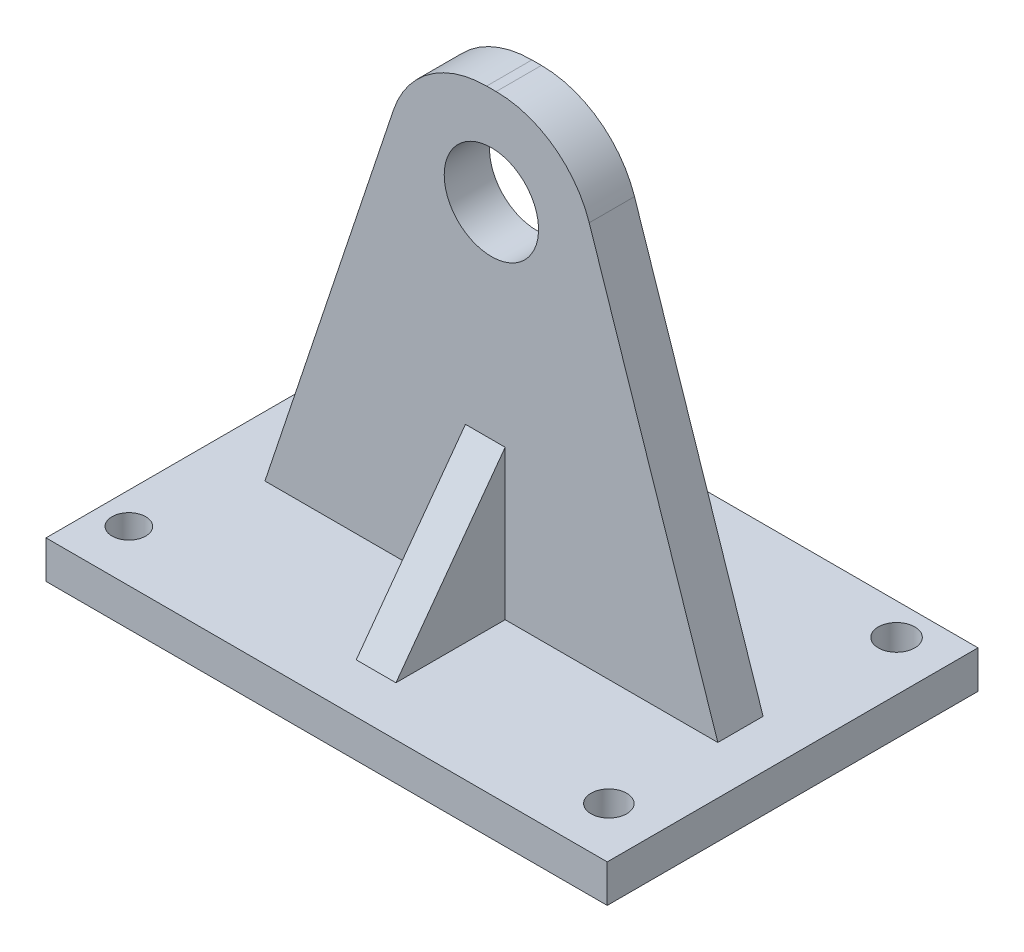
ISO-10303-21;
HEADER;
FILE_DESCRIPTION(('STEP AP214'),'2;1');
FILE_NAME('part.step','',(''),(''),'','','');
FILE_SCHEMA(('AUTOMOTIVE_DESIGN { 1 0 10303 214 1 1 1 1 }'));
ENDSEC;
DATA;
#1=APPLICATION_CONTEXT('core data for automotive mechanical design processes');
#2=APPLICATION_PROTOCOL_DEFINITION('international standard','automotive_design',2000,#1);
#3=PRODUCT_CONTEXT('',#1,'mechanical');
#4=PRODUCT('Part','Part','',(#3));
#5=PRODUCT_RELATED_PRODUCT_CATEGORY('part','',(#4));
#6=PRODUCT_DEFINITION_FORMATION('','',#4);
#7=PRODUCT_DEFINITION_CONTEXT('part definition',#1,'design');
#8=PRODUCT_DEFINITION('design','',#6,#7);
#9=PRODUCT_DEFINITION_SHAPE('','',#8);
#10=(LENGTH_UNIT() NAMED_UNIT(*) SI_UNIT(.MILLI.,.METRE.));
#11=(NAMED_UNIT(*) PLANE_ANGLE_UNIT() SI_UNIT($,.RADIAN.));
#12=(NAMED_UNIT(*) SI_UNIT($,.STERADIAN.) SOLID_ANGLE_UNIT());
#13=UNCERTAINTY_MEASURE_WITH_UNIT(LENGTH_MEASURE(1.E-05),#10,'distance_accuracy_value','');
#14=(GEOMETRIC_REPRESENTATION_CONTEXT(3) GLOBAL_UNCERTAINTY_ASSIGNED_CONTEXT((#13)) GLOBAL_UNIT_ASSIGNED_CONTEXT((#10,
#11,#12)) REPRESENTATION_CONTEXT('',''));
#15=CARTESIAN_POINT('',(0.,0.,0.));
#16=DIRECTION('',(0.,0.,1.));
#17=DIRECTION('',(1.,0.,0.));
#18=AXIS2_PLACEMENT_3D('',#15,#16,#17);
#19=CARTESIAN_POINT('',(38.9002652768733,59.69,7.62));
#20=DIRECTION('',(0.,0.,1.));
#21=DIRECTION('',(1.,0.,0.));
#22=AXIS2_PLACEMENT_3D('',#19,#20,#21);
#23=PLANE('',#22);
#24=DIRECTION('',(-0.316227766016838,0.948683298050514,0.));
#25=VECTOR('',#24,1.);
#26=CARTESIAN_POINT('',(76.2,0.,7.62));
#27=LINE('',#26,#25);
#28=CARTESIAN_POINT('',(76.2,0.,7.62));
#29=VERTEX_POINT('',#28);
#30=CARTESIAN_POINT('',(54.5630265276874,64.9109204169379,7.62));
#31=VERTEX_POINT('',#30);
#32=EDGE_CURVE('E257',#29,#31,#27,.T.);
#33=ORIENTED_EDGE('',*,*,#32,.T.);
#34=CARTESIAN_POINT('',(38.9002652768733,59.69,7.62));
#35=DIRECTION('',(0.,0.,1.));
#36=DIRECTION('',(1.,0.,0.));
#37=AXIS2_PLACEMENT_3D('',#34,#35,#36);
#38=CIRCLE('',#37,16.51);
#39=CARTESIAN_POINT('',(38.9002652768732,76.2,7.62));
#40=VERTEX_POINT('',#39);
#41=EDGE_CURVE('E259',#31,#40,#38,.T.);
#42=ORIENTED_EDGE('',*,*,#41,.T.);
#43=DIRECTION('',(-1.,0.,0.));
#44=VECTOR('',#43,1.);
#45=CARTESIAN_POINT('',(38.9002652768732,76.2,7.62));
#46=LINE('',#45,#44);
#47=CARTESIAN_POINT('',(37.2997347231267,76.2,7.62));
#48=VERTEX_POINT('',#47);
#49=EDGE_CURVE('E261',#40,#48,#46,.T.);
#50=ORIENTED_EDGE('',*,*,#49,.T.);
#51=CARTESIAN_POINT('',(37.2997347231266,59.69,7.62));
#52=DIRECTION('',(0.,0.,1.));
#53=DIRECTION('',(-1.,0.,0.));
#54=AXIS2_PLACEMENT_3D('',#51,#52,#53);
#55=CIRCLE('',#54,16.51);
#56=CARTESIAN_POINT('',(21.6369734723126,64.9109204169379,7.62));
#57=VERTEX_POINT('',#56);
#58=EDGE_CURVE('E263',#48,#57,#55,.T.);
#59=ORIENTED_EDGE('',*,*,#58,.T.);
#60=DIRECTION('',(-0.316227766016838,-0.948683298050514,0.));
#61=VECTOR('',#60,1.);
#62=CARTESIAN_POINT('',(21.6369734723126,64.9109204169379,7.62));
#63=LINE('',#62,#61);
#64=CARTESIAN_POINT('',(0.,0.,7.62));
#65=VERTEX_POINT('',#64);
#66=EDGE_CURVE('E251',#57,#65,#63,.T.);
#67=ORIENTED_EDGE('',*,*,#66,.T.);
#68=DIRECTION('',(1.,0.,0.));
#69=VECTOR('',#68,1.);
#70=CARTESIAN_POINT('',(0.,0.,7.62));
#71=LINE('',#70,#69);
#72=CARTESIAN_POINT('',(33.7352719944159,0.,7.62));
#73=VERTEX_POINT('',#72);
#74=EDGE_CURVE('E254',#65,#73,#71,.T.);
#75=ORIENTED_EDGE('',*,*,#74,.T.);
#76=DIRECTION('',(0.,-1.,0.));
#77=VECTOR('',#76,1.);
#78=CARTESIAN_POINT('',(33.7352719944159,0.,7.62));
#79=LINE('',#78,#77);
#80=CARTESIAN_POINT('',(33.7352719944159,25.1294228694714,7.62));
#81=VERTEX_POINT('',#80);
#82=EDGE_CURVE('E197',#81,#73,#79,.T.);
#83=ORIENTED_EDGE('',*,*,#82,.F.);
#84=DIRECTION('',(-1.,0.,0.));
#85=VECTOR('',#84,1.);
#86=CARTESIAN_POINT('',(40.4193128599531,25.1294228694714,7.62));
#87=LINE('',#86,#85);
#88=CARTESIAN_POINT('',(40.4193128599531,25.1294228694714,7.62));
#89=VERTEX_POINT('',#88);
#90=EDGE_CURVE('E194',#89,#81,#87,.T.);
#91=ORIENTED_EDGE('',*,*,#90,.F.);
#92=DIRECTION('',(0.,1.,0.));
#93=VECTOR('',#92,1.);
#94=CARTESIAN_POINT('',(40.4193128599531,0.,7.62));
#95=LINE('',#94,#93);
#96=CARTESIAN_POINT('',(40.4193128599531,0.,7.62));
#97=VERTEX_POINT('',#96);
#98=EDGE_CURVE('E192',#97,#89,#95,.T.);
#99=ORIENTED_EDGE('',*,*,#98,.F.);
#100=EDGE_CURVE('E253',#97,#29,#71,.T.);
#101=ORIENTED_EDGE('',*,*,#100,.T.);
#102=EDGE_LOOP('',(#33,#42,#50,#59,#67,#75,#83,#91,#99,#101));
#103=FACE_BOUND('',#102,.T.);
#104=CARTESIAN_POINT('',(38.1,59.69,7.62));
#105=DIRECTION('',(0.,0.,1.));
#106=DIRECTION('',(1.,0.,0.));
#107=AXIS2_PLACEMENT_3D('',#104,#105,#106);
#108=CIRCLE('',#107,7.93673466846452);
#109=CARTESIAN_POINT('',(30.1632653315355,59.69,7.62));
#110=VERTEX_POINT('',#109);
#111=EDGE_CURVE('E239',#110,#110,#108,.T.);
#112=ORIENTED_EDGE('',*,*,#111,.F.);
#113=EDGE_LOOP('',(#112));
#114=FACE_BOUND('',#113,.T.);
#115=ADVANCED_FACE('F34',(#103,#114),#23,.T.);
#116=CARTESIAN_POINT('',(-10.137707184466,0.,-28.0643860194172));
#117=DIRECTION('',(0.,-1.,0.));
#118=DIRECTION('',(0.,0.,-1.));
#119=AXIS2_PLACEMENT_3D('',#116,#117,#118);
#120=PLANE('',#119);
#121=CARTESIAN_POINT('',(-4.8379274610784,0.,25.6797639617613));
#122=DIRECTION('',(0.,1.,0.));
#123=DIRECTION('',(0.,0.,1.));
#124=AXIS2_PLACEMENT_3D('',#121,#122,#123);
#125=CIRCLE('',#124,2.83370500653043);
#126=CARTESIAN_POINT('',(-4.8379274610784,0.,28.5134689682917));
#127=VERTEX_POINT('',#126);
#128=EDGE_CURVE('E292',#127,#127,#125,.T.);
#129=ORIENTED_EDGE('',*,*,#128,.F.);
#130=EDGE_LOOP('',(#129));
#131=FACE_BOUND('',#130,.T.);
#132=CARTESIAN_POINT('',(-4.8379274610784,0.,-22.7293632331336));
#133=DIRECTION('',(0.,1.,0.));
#134=DIRECTION('',(0.,0.,1.));
#135=AXIS2_PLACEMENT_3D('',#132,#133,#134);
#136=CIRCLE('',#135,2.83370500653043);
#137=CARTESIAN_POINT('',(-4.8379274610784,0.,-19.8956582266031));
#138=VERTEX_POINT('',#137);
#139=EDGE_CURVE('E283',#138,#138,#136,.T.);
#140=ORIENTED_EDGE('',*,*,#139,.F.);
#141=EDGE_LOOP('',(#140));
#142=FACE_BOUND('',#141,.T.);
#143=CARTESIAN_POINT('',(75.9226652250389,0.,-22.7293632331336));
#144=DIRECTION('',(0.,1.,0.));
#145=DIRECTION('',(0.,0.,1.));
#146=AXIS2_PLACEMENT_3D('',#143,#144,#145);
#147=CIRCLE('',#146,3.06984709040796);
#148=CARTESIAN_POINT('',(75.9226652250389,0.,-19.6595161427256));
#149=VERTEX_POINT('',#148);
#150=EDGE_CURVE('E280',#149,#149,#147,.T.);
#151=ORIENTED_EDGE('',*,*,#150,.F.);
#152=EDGE_LOOP('',(#151));
#153=FACE_BOUND('',#152,.T.);
#154=CARTESIAN_POINT('',(75.9226652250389,0.,25.6797639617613));
#155=DIRECTION('',(0.,1.,0.));
#156=DIRECTION('',(0.,0.,1.));
#157=AXIS2_PLACEMENT_3D('',#154,#155,#156);
#158=CIRCLE('',#157,3.00559803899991);
#159=CARTESIAN_POINT('',(75.9226652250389,0.,28.6853620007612));
#160=VERTEX_POINT('',#159);
#161=EDGE_CURVE('E172',#160,#160,#158,.T.);
#162=ORIENTED_EDGE('',*,*,#161,.F.);
#163=EDGE_LOOP('',(#162));
#164=FACE_BOUND('',#163,.T.);
#165=DIRECTION('',(1.,0.,0.));
#166=VECTOR('',#165,1.);
#167=CARTESIAN_POINT('',(0.,0.,0.));
#168=LINE('',#167,#166);
#169=CARTESIAN_POINT('',(0.,0.,0.));
#170=VERTEX_POINT('',#169);
#171=CARTESIAN_POINT('',(34.0434661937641,0.,0.));
#172=VERTEX_POINT('',#171);
#173=EDGE_CURVE('E157',#170,#172,#168,.T.);
#174=ORIENTED_EDGE('',*,*,#173,.T.);
#175=DIRECTION('',(0.,0.,-1.));
#176=VECTOR('',#175,1.);
#177=CARTESIAN_POINT('',(34.0434661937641,0.,-19.1135272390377));
#178=LINE('',#177,#176);
#179=CARTESIAN_POINT('',(34.0434661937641,0.,-19.1135272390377));
#180=VERTEX_POINT('',#179);
#181=EDGE_CURVE('E51',#172,#180,#178,.T.);
#182=ORIENTED_EDGE('',*,*,#181,.T.);
#183=DIRECTION('',(1.,0.,0.));
#184=VECTOR('',#183,1.);
#185=CARTESIAN_POINT('',(34.0434661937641,0.,-19.1135272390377));
#186=LINE('',#185,#184);
#187=CARTESIAN_POINT('',(40.4193128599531,0.,-19.1135272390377));
#188=VERTEX_POINT('',#187);
#189=EDGE_CURVE('E55',#180,#188,#186,.T.);
#190=ORIENTED_EDGE('',*,*,#189,.T.);
#191=DIRECTION('',(0.,0.,-1.));
#192=VECTOR('',#191,1.);
#193=CARTESIAN_POINT('',(40.4193128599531,0.,-19.1135272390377));
#194=LINE('',#193,#192);
#195=CARTESIAN_POINT('',(40.4193128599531,0.,0.));
#196=VERTEX_POINT('',#195);
#197=EDGE_CURVE('E160',#196,#188,#194,.T.);
#198=ORIENTED_EDGE('',*,*,#197,.F.);
#199=CARTESIAN_POINT('',(76.2,0.,0.));
#200=VERTEX_POINT('',#199);
#201=EDGE_CURVE('E147',#196,#200,#168,.T.);
#202=ORIENTED_EDGE('',*,*,#201,.T.);
#203=DIRECTION('',(0.,0.,-1.));
#204=VECTOR('',#203,1.);
#205=CARTESIAN_POINT('',(76.2,0.,7.62));
#206=LINE('',#205,#204);
#207=EDGE_CURVE('E43',#29,#200,#206,.T.);
#208=ORIENTED_EDGE('',*,*,#207,.F.);
#209=ORIENTED_EDGE('',*,*,#100,.F.);
#210=DIRECTION('',(0.,0.,-1.));
#211=VECTOR('',#210,1.);
#212=CARTESIAN_POINT('',(40.4193128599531,0.,25.995846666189));
#213=LINE('',#212,#211);
#214=CARTESIAN_POINT('',(40.419312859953,0.,25.995846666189));
#215=VERTEX_POINT('',#214);
#216=EDGE_CURVE('E202',#215,#97,#213,.T.);
#217=ORIENTED_EDGE('',*,*,#216,.F.);
#218=DIRECTION('',(1.,0.,0.));
#219=VECTOR('',#218,1.);
#220=CARTESIAN_POINT('',(40.4193128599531,0.,25.995846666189));
#221=LINE('',#220,#219);
#222=CARTESIAN_POINT('',(33.7352719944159,0.,25.995846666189));
#223=VERTEX_POINT('',#222);
#224=EDGE_CURVE('E199',#223,#215,#221,.T.);
#225=ORIENTED_EDGE('',*,*,#224,.F.);
#226=DIRECTION('',(0.,0.,-1.));
#227=VECTOR('',#226,1.);
#228=CARTESIAN_POINT('',(33.7352719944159,0.,25.995846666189));
#229=LINE('',#228,#227);
#230=EDGE_CURVE('E204',#223,#73,#229,.T.);
#231=ORIENTED_EDGE('',*,*,#230,.T.);
#232=ORIENTED_EDGE('',*,*,#74,.F.);
#233=DIRECTION('',(0.,0.,-1.));
#234=VECTOR('',#233,1.);
#235=CARTESIAN_POINT('',(0.,0.,7.62));
#236=LINE('',#235,#234);
#237=EDGE_CURVE('E11',#65,#170,#236,.T.);
#238=ORIENTED_EDGE('',*,*,#237,.T.);
#239=EDGE_LOOP('',(#174,#182,#190,#198,#202,#208,#209,#217,#225,#231,#232,#238));
#240=FACE_BOUND('',#239,.T.);
#241=DIRECTION('',(1.,0.,0.));
#242=VECTOR('',#241,1.);
#243=CARTESIAN_POINT('',(-10.137707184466,0.,-28.0643860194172));
#244=LINE('',#243,#242);
#245=CARTESIAN_POINT('',(-10.137707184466,0.,-28.0643860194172));
#246=VERTEX_POINT('',#245);
#247=CARTESIAN_POINT('',(84.292292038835,0.,-28.0643860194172));
#248=VERTEX_POINT('',#247);
#249=EDGE_CURVE('E209',#246,#248,#244,.T.);
#250=ORIENTED_EDGE('',*,*,#249,.F.);
#251=DIRECTION('',(0.,0.,-1.));
#252=VECTOR('',#251,1.);
#253=CARTESIAN_POINT('',(-10.137707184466,0.,34.3207759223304));
#254=LINE('',#253,#252);
#255=CARTESIAN_POINT('',(-10.137707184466,0.,34.3207759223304));
#256=VERTEX_POINT('',#255);
#257=EDGE_CURVE('E207',#256,#246,#254,.T.);
#258=ORIENTED_EDGE('',*,*,#257,.F.);
#259=DIRECTION('',(-1.,0.,0.));
#260=VECTOR('',#259,1.);
#261=CARTESIAN_POINT('',(-10.137707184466,0.,34.3207759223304));
#262=LINE('',#261,#260);
#263=CARTESIAN_POINT('',(84.292292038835,0.,34.3207759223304));
#264=VERTEX_POINT('',#263);
#265=EDGE_CURVE('E213',#264,#256,#262,.T.);
#266=ORIENTED_EDGE('',*,*,#265,.F.);
#267=DIRECTION('',(0.,0.,1.));
#268=VECTOR('',#267,1.);
#269=CARTESIAN_POINT('',(84.292292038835,0.,34.3207759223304));
#270=LINE('',#269,#268);
#271=EDGE_CURVE('E211',#248,#264,#270,.T.);
#272=ORIENTED_EDGE('',*,*,#271,.F.);
#273=EDGE_LOOP('',(#250,#258,#266,#272));
#274=FACE_BOUND('',#273,.T.);
#275=ADVANCED_FACE('F161',(#131,#142,#153,#164,#240,#274),#120,.F.);
#276=CARTESIAN_POINT('',(38.9002652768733,59.69,0.));
#277=DIRECTION('',(0.,0.,1.));
#278=DIRECTION('',(1.,0.,0.));
#279=AXIS2_PLACEMENT_3D('',#276,#277,#278);
#280=PLANE('',#279);
#281=DIRECTION('',(1.,0.,0.));
#282=VECTOR('',#281,1.);
#283=CARTESIAN_POINT('',(34.0434661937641,24.8989387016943,0.));
#284=LINE('',#283,#282);
#285=CARTESIAN_POINT('',(34.0434661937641,24.8989387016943,0.));
#286=VERTEX_POINT('',#285);
#287=CARTESIAN_POINT('',(40.4193128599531,24.8989387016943,0.));
#288=VERTEX_POINT('',#287);
#289=EDGE_CURVE('E184',#286,#288,#284,.T.);
#290=ORIENTED_EDGE('',*,*,#289,.F.);
#291=DIRECTION('',(0.,-1.,0.));
#292=VECTOR('',#291,1.);
#293=CARTESIAN_POINT('',(34.0434661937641,24.8989387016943,0.));
#294=LINE('',#293,#292);
#295=EDGE_CURVE('E178',#286,#172,#294,.T.);
#296=ORIENTED_EDGE('',*,*,#295,.T.);
#297=ORIENTED_EDGE('',*,*,#173,.F.);
#298=DIRECTION('',(-0.316227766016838,-0.948683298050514,0.));
#299=VECTOR('',#298,1.);
#300=CARTESIAN_POINT('',(21.6369734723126,64.9109204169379,0.));
#301=LINE('',#300,#299);
#302=CARTESIAN_POINT('',(21.6369734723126,64.9109204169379,0.));
#303=VERTEX_POINT('',#302);
#304=EDGE_CURVE('E158',#303,#170,#301,.T.);
#305=ORIENTED_EDGE('',*,*,#304,.F.);
#306=CARTESIAN_POINT('',(37.2997347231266,59.69,0.));
#307=DIRECTION('',(0.,0.,1.));
#308=DIRECTION('',(-1.,0.,0.));
#309=AXIS2_PLACEMENT_3D('',#306,#307,#308);
#310=CIRCLE('',#309,16.51);
#311=CARTESIAN_POINT('',(37.2997347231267,76.2,0.));
#312=VERTEX_POINT('',#311);
#313=EDGE_CURVE('E249',#312,#303,#310,.T.);
#314=ORIENTED_EDGE('',*,*,#313,.F.);
#315=DIRECTION('',(-1.,0.,0.));
#316=VECTOR('',#315,1.);
#317=CARTESIAN_POINT('',(38.9002652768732,76.2,0.));
#318=LINE('',#317,#316);
#319=CARTESIAN_POINT('',(38.9002652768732,76.2,0.));
#320=VERTEX_POINT('',#319);
#321=EDGE_CURVE('E247',#320,#312,#318,.T.);
#322=ORIENTED_EDGE('',*,*,#321,.F.);
#323=CARTESIAN_POINT('',(38.9002652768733,59.69,0.));
#324=DIRECTION('',(0.,0.,1.));
#325=DIRECTION('',(1.,0.,0.));
#326=AXIS2_PLACEMENT_3D('',#323,#324,#325);
#327=CIRCLE('',#326,16.51);
#328=CARTESIAN_POINT('',(54.5630265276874,64.9109204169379,0.));
#329=VERTEX_POINT('',#328);
#330=EDGE_CURVE('E245',#329,#320,#327,.T.);
#331=ORIENTED_EDGE('',*,*,#330,.F.);
#332=DIRECTION('',(-0.316227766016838,0.948683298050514,0.));
#333=VECTOR('',#332,1.);
#334=CARTESIAN_POINT('',(76.2,0.,0.));
#335=LINE('',#334,#333);
#336=EDGE_CURVE('E154',#200,#329,#335,.T.);
#337=ORIENTED_EDGE('',*,*,#336,.F.);
#338=ORIENTED_EDGE('',*,*,#201,.F.);
#339=DIRECTION('',(0.,-1.,0.));
#340=VECTOR('',#339,1.);
#341=CARTESIAN_POINT('',(40.4193128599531,24.8989387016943,0.));
#342=LINE('',#341,#340);
#343=EDGE_CURVE('E151',#288,#196,#342,.T.);
#344=ORIENTED_EDGE('',*,*,#343,.F.);
#345=EDGE_LOOP('',(#290,#296,#297,#305,#314,#322,#331,#337,#338,#344));
#346=FACE_BOUND('',#345,.T.);
#347=CARTESIAN_POINT('',(38.1,59.69,0.));
#348=DIRECTION('',(0.,0.,1.));
#349=DIRECTION('',(1.,0.,0.));
#350=AXIS2_PLACEMENT_3D('',#347,#348,#349);
#351=CIRCLE('',#350,7.93673466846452);
#352=CARTESIAN_POINT('',(30.1632653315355,59.69,0.));
#353=VERTEX_POINT('',#352);
#354=EDGE_CURVE('E236',#353,#353,#351,.T.);
#355=ORIENTED_EDGE('',*,*,#354,.T.);
#356=EDGE_LOOP('',(#355));
#357=FACE_BOUND('',#356,.T.);
#358=ADVANCED_FACE('F148',(#346,#357),#280,.F.);
#359=CARTESIAN_POINT('',(21.6369734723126,64.9109204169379,7.62));
#360=DIRECTION('',(0.948683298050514,-0.316227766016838,0.));
#361=DIRECTION('',(0.316227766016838,0.948683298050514,0.));
#362=AXIS2_PLACEMENT_3D('',#359,#360,#361);
#363=PLANE('',#362);
#364=ORIENTED_EDGE('',*,*,#304,.T.);
#365=ORIENTED_EDGE('',*,*,#237,.F.);
#366=ORIENTED_EDGE('',*,*,#66,.F.);
#367=DIRECTION('',(0.,0.,-1.));
#368=VECTOR('',#367,1.);
#369=CARTESIAN_POINT('',(21.6369734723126,64.9109204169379,7.62));
#370=LINE('',#369,#368);
#371=EDGE_CURVE('E265',#57,#303,#370,.T.);
#372=ORIENTED_EDGE('',*,*,#371,.T.);
#373=EDGE_LOOP('',(#364,#365,#366,#372));
#374=FACE_BOUND('',#373,.T.);
#375=ADVANCED_FACE('F36',(#374),#363,.F.);
#376=CARTESIAN_POINT('',(76.2,0.,7.62));
#377=DIRECTION('',(-0.948683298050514,-0.316227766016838,0.));
#378=DIRECTION('',(0.316227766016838,-0.948683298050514,0.));
#379=AXIS2_PLACEMENT_3D('',#376,#377,#378);
#380=PLANE('',#379);
#381=ORIENTED_EDGE('',*,*,#336,.T.);
#382=DIRECTION('',(0.,0.,-1.));
#383=VECTOR('',#382,1.);
#384=CARTESIAN_POINT('',(54.5630265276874,64.9109204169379,7.62));
#385=LINE('',#384,#383);
#386=EDGE_CURVE('E274',#31,#329,#385,.T.);
#387=ORIENTED_EDGE('',*,*,#386,.F.);
#388=ORIENTED_EDGE('',*,*,#32,.F.);
#389=ORIENTED_EDGE('',*,*,#207,.T.);
#390=EDGE_LOOP('',(#381,#387,#388,#389));
#391=FACE_BOUND('',#390,.T.);
#392=ADVANCED_FACE('F342',(#391),#380,.F.);
#393=CARTESIAN_POINT('',(38.9002652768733,59.69,7.62));
#394=DIRECTION('',(0.,0.,-1.));
#395=DIRECTION('',(-1.,0.,0.));
#396=AXIS2_PLACEMENT_3D('',#393,#394,#395);
#397=CYLINDRICAL_SURFACE('',#396,16.51);
#398=ORIENTED_EDGE('',*,*,#330,.T.);
#399=DIRECTION('',(0.,0.,-1.));
#400=VECTOR('',#399,1.);
#401=CARTESIAN_POINT('',(38.9002652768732,76.2,7.62));
#402=LINE('',#401,#400);
#403=EDGE_CURVE('E271',#40,#320,#402,.T.);
#404=ORIENTED_EDGE('',*,*,#403,.F.);
#405=ORIENTED_EDGE('',*,*,#41,.F.);
#406=ORIENTED_EDGE('',*,*,#386,.T.);
#407=EDGE_LOOP('',(#398,#404,#405,#406));
#408=FACE_BOUND('',#407,.T.);
#409=ADVANCED_FACE('F339',(#408),#397,.T.);
#410=CARTESIAN_POINT('',(38.9002652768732,76.2,7.62));
#411=DIRECTION('',(0.,-1.,0.));
#412=DIRECTION('',(0.,0.,-1.));
#413=AXIS2_PLACEMENT_3D('',#410,#411,#412);
#414=PLANE('',#413);
#415=ORIENTED_EDGE('',*,*,#321,.T.);
#416=DIRECTION('',(0.,0.,-1.));
#417=VECTOR('',#416,1.);
#418=CARTESIAN_POINT('',(37.2997347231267,76.2,7.62));
#419=LINE('',#418,#417);
#420=EDGE_CURVE('E268',#48,#312,#419,.T.);
#421=ORIENTED_EDGE('',*,*,#420,.F.);
#422=ORIENTED_EDGE('',*,*,#49,.F.);
#423=ORIENTED_EDGE('',*,*,#403,.T.);
#424=EDGE_LOOP('',(#415,#421,#422,#423));
#425=FACE_BOUND('',#424,.T.);
#426=ADVANCED_FACE('F335',(#425),#414,.F.);
#427=CARTESIAN_POINT('',(37.2997347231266,59.69,7.62));
#428=DIRECTION('',(0.,0.,-1.));
#429=DIRECTION('',(-1.,0.,0.));
#430=AXIS2_PLACEMENT_3D('',#427,#428,#429);
#431=CYLINDRICAL_SURFACE('',#430,16.51);
#432=ORIENTED_EDGE('',*,*,#313,.T.);
#433=ORIENTED_EDGE('',*,*,#371,.F.);
#434=ORIENTED_EDGE('',*,*,#58,.F.);
#435=ORIENTED_EDGE('',*,*,#420,.T.);
#436=EDGE_LOOP('',(#432,#433,#434,#435));
#437=FACE_BOUND('',#436,.T.);
#438=ADVANCED_FACE('F331',(#437),#431,.T.);
#439=CARTESIAN_POINT('',(38.1,59.69,7.62));
#440=DIRECTION('',(0.,0.,-1.));
#441=DIRECTION('',(-1.,0.,0.));
#442=AXIS2_PLACEMENT_3D('',#439,#440,#441);
#443=CYLINDRICAL_SURFACE('',#442,7.93673466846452);
#444=CARTESIAN_POINT('',(30.1632653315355,59.69,7.62));
#445=CARTESIAN_POINT('',(30.1632653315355,59.69,7.540625));
#446=CARTESIAN_POINT('',(30.1632653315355,59.69,7.46125));
#447=CARTESIAN_POINT('',(30.1632653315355,59.69,7.3025));
#448=CARTESIAN_POINT('',(30.1632653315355,59.69,7.223125));
#449=CARTESIAN_POINT('',(30.1632653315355,59.69,7.064375));
#450=CARTESIAN_POINT('',(30.1632653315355,59.69,6.985));
#451=CARTESIAN_POINT('',(30.1632653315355,59.69,6.82625));
#452=CARTESIAN_POINT('',(30.1632653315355,59.69,6.746875));
#453=CARTESIAN_POINT('',(30.1632653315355,59.69,6.588125));
#454=CARTESIAN_POINT('',(30.1632653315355,59.69,6.50875));
#455=CARTESIAN_POINT('',(30.1632653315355,59.69,6.35));
#456=CARTESIAN_POINT('',(30.1632653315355,59.69,6.270625));
#457=CARTESIAN_POINT('',(30.1632653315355,59.69,6.111875));
#458=CARTESIAN_POINT('',(30.1632653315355,59.69,6.0325));
#459=CARTESIAN_POINT('',(30.1632653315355,59.69,5.87375));
#460=CARTESIAN_POINT('',(30.1632653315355,59.69,5.794375));
#461=CARTESIAN_POINT('',(30.1632653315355,59.69,5.635625));
#462=CARTESIAN_POINT('',(30.1632653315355,59.69,5.55625));
#463=CARTESIAN_POINT('',(30.1632653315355,59.69,5.3975));
#464=CARTESIAN_POINT('',(30.1632653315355,59.69,5.318125));
#465=CARTESIAN_POINT('',(30.1632653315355,59.69,5.159375));
#466=CARTESIAN_POINT('',(30.1632653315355,59.69,5.08));
#467=CARTESIAN_POINT('',(30.1632653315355,59.69,4.92125));
#468=CARTESIAN_POINT('',(30.1632653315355,59.69,4.841875));
#469=CARTESIAN_POINT('',(30.1632653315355,59.69,4.683125));
#470=CARTESIAN_POINT('',(30.1632653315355,59.69,4.60375));
#471=CARTESIAN_POINT('',(30.1632653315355,59.69,4.445));
#472=CARTESIAN_POINT('',(30.1632653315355,59.69,4.365625));
#473=CARTESIAN_POINT('',(30.1632653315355,59.69,4.206875));
#474=CARTESIAN_POINT('',(30.1632653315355,59.69,4.1275));
#475=CARTESIAN_POINT('',(30.1632653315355,59.69,3.96875));
#476=CARTESIAN_POINT('',(30.1632653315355,59.69,3.889375));
#477=CARTESIAN_POINT('',(30.1632653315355,59.69,3.730625));
#478=CARTESIAN_POINT('',(30.1632653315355,59.69,3.65125));
#479=CARTESIAN_POINT('',(30.1632653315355,59.69,3.4925));
#480=CARTESIAN_POINT('',(30.1632653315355,59.69,3.413125));
#481=CARTESIAN_POINT('',(30.1632653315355,59.69,3.254375));
#482=CARTESIAN_POINT('',(30.1632653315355,59.69,3.175));
#483=CARTESIAN_POINT('',(30.1632653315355,59.69,3.01625));
#484=CARTESIAN_POINT('',(30.1632653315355,59.69,2.936875));
#485=CARTESIAN_POINT('',(30.1632653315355,59.69,2.778125));
#486=CARTESIAN_POINT('',(30.1632653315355,59.69,2.69875));
#487=CARTESIAN_POINT('',(30.1632653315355,59.69,2.54));
#488=CARTESIAN_POINT('',(30.1632653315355,59.69,2.460625));
#489=CARTESIAN_POINT('',(30.1632653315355,59.69,2.301875));
#490=CARTESIAN_POINT('',(30.1632653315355,59.69,2.2225));
#491=CARTESIAN_POINT('',(30.1632653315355,59.69,2.06375));
#492=CARTESIAN_POINT('',(30.1632653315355,59.69,1.984375));
#493=CARTESIAN_POINT('',(30.1632653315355,59.69,1.825625));
#494=CARTESIAN_POINT('',(30.1632653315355,59.69,1.74625));
#495=CARTESIAN_POINT('',(30.1632653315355,59.69,1.5875));
#496=CARTESIAN_POINT('',(30.1632653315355,59.69,1.508125));
#497=CARTESIAN_POINT('',(30.1632653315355,59.69,1.349375));
#498=CARTESIAN_POINT('',(30.1632653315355,59.69,1.27));
#499=CARTESIAN_POINT('',(30.1632653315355,59.69,1.11125));
#500=CARTESIAN_POINT('',(30.1632653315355,59.69,1.031875));
#501=CARTESIAN_POINT('',(30.1632653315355,59.69,0.873125));
#502=CARTESIAN_POINT('',(30.1632653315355,59.69,0.79375));
#503=CARTESIAN_POINT('',(30.1632653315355,59.69,0.635));
#504=CARTESIAN_POINT('',(30.1632653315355,59.69,0.555625));
#505=CARTESIAN_POINT('',(30.1632653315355,59.69,0.396875));
#506=CARTESIAN_POINT('',(30.1632653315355,59.69,0.3175));
#507=CARTESIAN_POINT('',(30.1632653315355,59.69,0.15875));
#508=CARTESIAN_POINT('',(30.1632653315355,59.69,0.0793749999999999));
#509=CARTESIAN_POINT('',(30.1632653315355,59.69,0.));
#510=B_SPLINE_CURVE_WITH_KNOTS('',3,(#444,#445,#446,#447,#448,#449,#450,#451,#452,#453,#454,
#455,#456,#457,#458,#459,#460,#461,#462,#463,#464,#465,#466,#467,#468,#469,#470,#471,#472,#473,
#474,#475,#476,#477,#478,#479,#480,#481,#482,#483,#484,#485,#486,#487,#488,#489,#490,#491,#492,
#493,#494,#495,#496,#497,#498,#499,#500,#501,#502,#503,#504,#505,#506,#507,#508,#509),
.UNSPECIFIED.,.F.,.F.,(4,2,2,2,2,2,2,2,2,2,2,2,2,2,2,2,2,2,2,2,2,2,2,2,2,2,2,2,2,2,2,2,4),(0.,
0.238125,0.47625,0.714375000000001,0.9525,1.190625,1.42875,1.666875,1.905,2.143125,2.38125,
2.619375,2.8575,3.095625,3.33375,3.571875,3.81,4.048125,4.28625,4.524375,4.7625,5.000625,
5.23875,5.476875,5.715,5.953125,6.19125,6.429375,6.6675,6.905625,7.14375,7.381875,7.62),.UNSPECIFIED.);
#511=EDGE_CURVE('BSEAM334',#110,#353,#510,.T.);
#512=ORIENTED_EDGE('',*,*,#111,.T.);
#513=ORIENTED_EDGE('',*,*,#354,.F.);
#514=ORIENTED_EDGE('',*,*,#511,.T.);
#515=ORIENTED_EDGE('',*,*,#511,.F.);
#516=EDGE_LOOP('',(#512,#514,#513,#515));
#517=FACE_BOUND('',#516,.T.);
#518=ADVANCED_FACE('F334',(#517),#443,.F.);
#519=CARTESIAN_POINT('',(-10.137707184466,-6.35,34.3207759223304));
#520=DIRECTION('',(1.,0.,0.));
#521=DIRECTION('',(0.,0.,-1.));
#522=AXIS2_PLACEMENT_3D('',#519,#520,#521);
#523=PLANE('',#522);
#524=ORIENTED_EDGE('',*,*,#257,.T.);
#525=DIRECTION('',(0.,1.,0.));
#526=VECTOR('',#525,1.);
#527=CARTESIAN_POINT('',(-10.137707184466,-6.35,-28.0643860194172));
#528=LINE('',#527,#526);
#529=CARTESIAN_POINT('',(-10.137707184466,-6.35,-28.0643860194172));
#530=VERTEX_POINT('',#529);
#531=EDGE_CURVE('E233',#530,#246,#528,.T.);
#532=ORIENTED_EDGE('',*,*,#531,.F.);
#533=DIRECTION('',(0.,0.,-1.));
#534=VECTOR('',#533,1.);
#535=CARTESIAN_POINT('',(-10.137707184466,-6.35,34.3207759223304));
#536=LINE('',#535,#534);
#537=CARTESIAN_POINT('',(-10.137707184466,-6.35,34.3207759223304));
#538=VERTEX_POINT('',#537);
#539=EDGE_CURVE('E215',#538,#530,#536,.T.);
#540=ORIENTED_EDGE('',*,*,#539,.F.);
#541=DIRECTION('',(0.,1.,0.));
#542=VECTOR('',#541,1.);
#543=CARTESIAN_POINT('',(-10.137707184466,-6.35,34.3207759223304));
#544=LINE('',#543,#542);
#545=EDGE_CURVE('E224',#538,#256,#544,.T.);
#546=ORIENTED_EDGE('',*,*,#545,.T.);
#547=EDGE_LOOP('',(#524,#532,#540,#546));
#548=FACE_BOUND('',#547,.T.);
#549=ADVANCED_FACE('F411',(#548),#523,.F.);
#550=CARTESIAN_POINT('',(-10.137707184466,-6.35,-28.0643860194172));
#551=DIRECTION('',(0.,0.,1.));
#552=DIRECTION('',(1.,0.,0.));
#553=AXIS2_PLACEMENT_3D('',#550,#551,#552);
#554=PLANE('',#553);
#555=ORIENTED_EDGE('',*,*,#249,.T.);
#556=DIRECTION('',(0.,1.,0.));
#557=VECTOR('',#556,1.);
#558=CARTESIAN_POINT('',(84.292292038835,-6.35,-28.0643860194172));
#559=LINE('',#558,#557);
#560=CARTESIAN_POINT('',(84.292292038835,-6.35,-28.0643860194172));
#561=VERTEX_POINT('',#560);
#562=EDGE_CURVE('E230',#561,#248,#559,.T.);
#563=ORIENTED_EDGE('',*,*,#562,.F.);
#564=DIRECTION('',(1.,0.,0.));
#565=VECTOR('',#564,1.);
#566=CARTESIAN_POINT('',(-10.137707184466,-6.35,-28.0643860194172));
#567=LINE('',#566,#565);
#568=EDGE_CURVE('E218',#530,#561,#567,.T.);
#569=ORIENTED_EDGE('',*,*,#568,.F.);
#570=ORIENTED_EDGE('',*,*,#531,.T.);
#571=EDGE_LOOP('',(#555,#563,#569,#570));
#572=FACE_BOUND('',#571,.T.);
#573=ADVANCED_FACE('F407',(#572),#554,.F.);
#574=CARTESIAN_POINT('',(84.292292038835,-6.35,34.3207759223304));
#575=DIRECTION('',(-1.,0.,0.));
#576=DIRECTION('',(0.,0.,1.));
#577=AXIS2_PLACEMENT_3D('',#574,#575,#576);
#578=PLANE('',#577);
#579=ORIENTED_EDGE('',*,*,#271,.T.);
#580=DIRECTION('',(0.,1.,0.));
#581=VECTOR('',#580,1.);
#582=CARTESIAN_POINT('',(84.292292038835,-6.35,34.3207759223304));
#583=LINE('',#582,#581);
#584=CARTESIAN_POINT('',(84.292292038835,-6.35,34.3207759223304));
#585=VERTEX_POINT('',#584);
#586=EDGE_CURVE('E227',#585,#264,#583,.T.);
#587=ORIENTED_EDGE('',*,*,#586,.F.);
#588=DIRECTION('',(0.,0.,1.));
#589=VECTOR('',#588,1.);
#590=CARTESIAN_POINT('',(84.292292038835,-6.35,34.3207759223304));
#591=LINE('',#590,#589);
#592=EDGE_CURVE('E220',#561,#585,#591,.T.);
#593=ORIENTED_EDGE('',*,*,#592,.F.);
#594=ORIENTED_EDGE('',*,*,#562,.T.);
#595=EDGE_LOOP('',(#579,#587,#593,#594));
#596=FACE_BOUND('',#595,.T.);
#597=ADVANCED_FACE('F403',(#596),#578,.F.);
#598=CARTESIAN_POINT('',(-10.137707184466,-6.35,34.3207759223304));
#599=DIRECTION('',(0.,0.,-1.));
#600=DIRECTION('',(-1.,0.,0.));
#601=AXIS2_PLACEMENT_3D('',#598,#599,#600);
#602=PLANE('',#601);
#603=ORIENTED_EDGE('',*,*,#265,.T.);
#604=ORIENTED_EDGE('',*,*,#545,.F.);
#605=DIRECTION('',(-1.,0.,0.));
#606=VECTOR('',#605,1.);
#607=CARTESIAN_POINT('',(-10.137707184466,-6.35,34.3207759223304));
#608=LINE('',#607,#606);
#609=EDGE_CURVE('E222',#585,#538,#608,.T.);
#610=ORIENTED_EDGE('',*,*,#609,.F.);
#611=ORIENTED_EDGE('',*,*,#586,.T.);
#612=EDGE_LOOP('',(#603,#604,#610,#611));
#613=FACE_BOUND('',#612,.T.);
#614=ADVANCED_FACE('F399',(#613),#602,.F.);
#615=CARTESIAN_POINT('',(-10.137707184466,-6.35,-28.0643860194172));
#616=DIRECTION('',(0.,-1.,0.));
#617=DIRECTION('',(0.,0.,-1.));
#618=AXIS2_PLACEMENT_3D('',#615,#616,#617);
#619=PLANE('',#618);
#620=CARTESIAN_POINT('',(-4.8379274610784,-6.35,25.6797639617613));
#621=DIRECTION('',(0.,-1.,0.));
#622=DIRECTION('',(0.,0.,-1.));
#623=AXIS2_PLACEMENT_3D('',#620,#621,#622);
#624=CIRCLE('',#623,2.83370500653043);
#625=CARTESIAN_POINT('',(-4.8379274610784,-6.35,22.8460589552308));
#626=VERTEX_POINT('',#625);
#627=EDGE_CURVE('E38',#626,#626,#624,.T.);
#628=ORIENTED_EDGE('',*,*,#627,.F.);
#629=EDGE_LOOP('',(#628));
#630=FACE_BOUND('',#629,.T.);
#631=CARTESIAN_POINT('',(-4.8379274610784,-6.35,-22.7293632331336));
#632=DIRECTION('',(0.,-1.,0.));
#633=DIRECTION('',(0.,0.,-1.));
#634=AXIS2_PLACEMENT_3D('',#631,#632,#633);
#635=CIRCLE('',#634,2.83370500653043);
#636=CARTESIAN_POINT('',(-4.8379274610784,-6.35,-25.563068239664));
#637=VERTEX_POINT('',#636);
#638=EDGE_CURVE('E281',#637,#637,#635,.T.);
#639=ORIENTED_EDGE('',*,*,#638,.F.);
#640=EDGE_LOOP('',(#639));
#641=FACE_BOUND('',#640,.T.);
#642=CARTESIAN_POINT('',(75.9226652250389,-6.35,-22.7293632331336));
#643=DIRECTION('',(0.,-1.,0.));
#644=DIRECTION('',(0.,0.,-1.));
#645=AXIS2_PLACEMENT_3D('',#642,#643,#644);
#646=CIRCLE('',#645,3.06984709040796);
#647=CARTESIAN_POINT('',(75.9226652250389,-6.35,-25.7992103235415));
#648=VERTEX_POINT('',#647);
#649=EDGE_CURVE('E278',#648,#648,#646,.T.);
#650=ORIENTED_EDGE('',*,*,#649,.F.);
#651=EDGE_LOOP('',(#650));
#652=FACE_BOUND('',#651,.T.);
#653=CARTESIAN_POINT('',(75.9226652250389,-6.35,25.6797639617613));
#654=DIRECTION('',(0.,-1.,0.));
#655=DIRECTION('',(0.,0.,-1.));
#656=AXIS2_PLACEMENT_3D('',#653,#654,#655);
#657=CIRCLE('',#656,3.00559803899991);
#658=CARTESIAN_POINT('',(75.9226652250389,-6.35,22.6741659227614));
#659=VERTEX_POINT('',#658);
#660=EDGE_CURVE('E169',#659,#659,#657,.T.);
#661=ORIENTED_EDGE('',*,*,#660,.F.);
#662=EDGE_LOOP('',(#661));
#663=FACE_BOUND('',#662,.T.);
#664=ORIENTED_EDGE('',*,*,#539,.T.);
#665=ORIENTED_EDGE('',*,*,#568,.T.);
#666=ORIENTED_EDGE('',*,*,#592,.T.);
#667=ORIENTED_EDGE('',*,*,#609,.T.);
#668=EDGE_LOOP('',(#664,#665,#666,#667));
#669=FACE_BOUND('',#668,.T.);
#670=ADVANCED_FACE('F395',(#630,#641,#652,#663,#669),#619,.T.);
#671=CARTESIAN_POINT('',(40.4193128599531,0.,25.995846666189));
#672=DIRECTION('',(-1.,0.,0.));
#673=DIRECTION('',(0.,0.,1.));
#674=AXIS2_PLACEMENT_3D('',#671,#672,#673);
#675=PLANE('',#674);
#676=ORIENTED_EDGE('',*,*,#98,.T.);
#677=DIRECTION('',(0.,-0.807206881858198,0.590268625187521));
#678=VECTOR('',#677,1.);
#679=CARTESIAN_POINT('',(40.4193128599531,0.,25.995846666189));
#680=LINE('',#679,#678);
#681=EDGE_CURVE('E189',#89,#215,#680,.T.);
#682=ORIENTED_EDGE('',*,*,#681,.T.);
#683=ORIENTED_EDGE('',*,*,#216,.T.);
#684=EDGE_LOOP('',(#676,#682,#683));
#685=FACE_BOUND('',#684,.T.);
#686=ADVANCED_FACE('F370',(#685),#675,.F.);
#687=CARTESIAN_POINT('',(33.7352719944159,0.,25.995846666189));
#688=DIRECTION('',(1.,0.,0.));
#689=DIRECTION('',(0.,0.,-1.));
#690=AXIS2_PLACEMENT_3D('',#687,#688,#689);
#691=PLANE('',#690);
#692=ORIENTED_EDGE('',*,*,#230,.F.);
#693=DIRECTION('',(0.,0.807206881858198,-0.590268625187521));
#694=VECTOR('',#693,1.);
#695=CARTESIAN_POINT('',(33.7352719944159,0.,25.995846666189));
#696=LINE('',#695,#694);
#697=EDGE_CURVE('E186',#223,#81,#696,.T.);
#698=ORIENTED_EDGE('',*,*,#697,.T.);
#699=ORIENTED_EDGE('',*,*,#82,.T.);
#700=EDGE_LOOP('',(#692,#698,#699));
#701=FACE_BOUND('',#700,.T.);
#702=ADVANCED_FACE('F375',(#701),#691,.F.);
#703=CARTESIAN_POINT('',(215.523905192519,0.,25.995846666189));
#704=DIRECTION('',(0.,-0.590268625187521,-0.807206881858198));
#705=DIRECTION('',(0.,0.807206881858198,-0.590268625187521));
#706=AXIS2_PLACEMENT_3D('',#703,#704,#705);
#707=PLANE('',#706);
#708=ORIENTED_EDGE('',*,*,#681,.F.);
#709=ORIENTED_EDGE('',*,*,#90,.T.);
#710=ORIENTED_EDGE('',*,*,#697,.F.);
#711=ORIENTED_EDGE('',*,*,#224,.T.);
#712=EDGE_LOOP('',(#708,#709,#710,#711));
#713=FACE_BOUND('',#712,.T.);
#714=ADVANCED_FACE('F372',(#713),#707,.F.);
#715=CARTESIAN_POINT('',(34.0434661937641,24.8989387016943,0.));
#716=DIRECTION('',(0.,0.608919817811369,-0.793231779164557));
#717=DIRECTION('',(0.,0.793231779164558,0.608919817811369));
#718=AXIS2_PLACEMENT_3D('',#715,#716,#717);
#719=PLANE('',#718);
#720=DIRECTION('',(0.,0.793231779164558,0.608919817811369));
#721=VECTOR('',#720,1.);
#722=CARTESIAN_POINT('',(40.4193128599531,24.8989387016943,0.));
#723=LINE('',#722,#721);
#724=EDGE_CURVE('E166',#188,#288,#723,.T.);
#725=ORIENTED_EDGE('',*,*,#724,.F.);
#726=ORIENTED_EDGE('',*,*,#189,.F.);
#727=DIRECTION('',(0.,0.793231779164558,0.608919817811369));
#728=VECTOR('',#727,1.);
#729=CARTESIAN_POINT('',(34.0434661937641,24.8989387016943,0.));
#730=LINE('',#729,#728);
#731=EDGE_CURVE('E181',#180,#286,#730,.T.);
#732=ORIENTED_EDGE('',*,*,#731,.T.);
#733=ORIENTED_EDGE('',*,*,#289,.T.);
#734=EDGE_LOOP('',(#725,#726,#732,#733));
#735=FACE_BOUND('',#734,.T.);
#736=ADVANCED_FACE('F382',(#735),#719,.T.);
#737=CARTESIAN_POINT('',(34.0434661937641,0.,0.));
#738=DIRECTION('',(-1.,0.,0.));
#739=DIRECTION('',(0.,0.,1.));
#740=AXIS2_PLACEMENT_3D('',#737,#738,#739);
#741=PLANE('',#740);
#742=ORIENTED_EDGE('',*,*,#295,.F.);
#743=ORIENTED_EDGE('',*,*,#731,.F.);
#744=ORIENTED_EDGE('',*,*,#181,.F.);
#745=EDGE_LOOP('',(#742,#743,#744));
#746=FACE_BOUND('',#745,.T.);
#747=ADVANCED_FACE('F320',(#746),#741,.T.);
#748=CARTESIAN_POINT('',(40.4193128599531,0.,0.));
#749=DIRECTION('',(-1.,0.,0.));
#750=DIRECTION('',(0.,0.,1.));
#751=AXIS2_PLACEMENT_3D('',#748,#749,#750);
#752=PLANE('',#751);
#753=ORIENTED_EDGE('',*,*,#343,.T.);
#754=ORIENTED_EDGE('',*,*,#197,.T.);
#755=ORIENTED_EDGE('',*,*,#724,.T.);
#756=EDGE_LOOP('',(#753,#754,#755));
#757=FACE_BOUND('',#756,.T.);
#758=ADVANCED_FACE('F168',(#757),#752,.F.);
#759=CARTESIAN_POINT('',(75.9226652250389,-10.,25.6797639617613));
#760=DIRECTION('',(0.,1.,0.));
#761=DIRECTION('',(0.,0.,1.));
#762=AXIS2_PLACEMENT_3D('',#759,#760,#761);
#763=CYLINDRICAL_SURFACE('',#762,3.00559803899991);
#764=ORIENTED_EDGE('',*,*,#660,.T.);
#765=EDGE_LOOP('',(#764));
#766=FACE_BOUND('',#765,.T.);
#767=ORIENTED_EDGE('',*,*,#161,.T.);
#768=EDGE_LOOP('',(#767));
#769=FACE_BOUND('',#768,.T.);
#770=ADVANCED_FACE('F308',(#766,#769),#763,.F.);
#771=CARTESIAN_POINT('',(75.9226652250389,-10.,-22.7293632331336));
#772=DIRECTION('',(0.,1.,0.));
#773=DIRECTION('',(0.,0.,1.));
#774=AXIS2_PLACEMENT_3D('',#771,#772,#773);
#775=CYLINDRICAL_SURFACE('',#774,3.06984709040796);
#776=ORIENTED_EDGE('',*,*,#649,.T.);
#777=EDGE_LOOP('',(#776));
#778=FACE_BOUND('',#777,.T.);
#779=ORIENTED_EDGE('',*,*,#150,.T.);
#780=EDGE_LOOP('',(#779));
#781=FACE_BOUND('',#780,.T.);
#782=ADVANCED_FACE('F310',(#778,#781),#775,.F.);
#783=CARTESIAN_POINT('',(-4.8379274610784,-10.,-22.7293632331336));
#784=DIRECTION('',(0.,1.,0.));
#785=DIRECTION('',(0.,0.,1.));
#786=AXIS2_PLACEMENT_3D('',#783,#784,#785);
#787=CYLINDRICAL_SURFACE('',#786,2.83370500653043);
#788=ORIENTED_EDGE('',*,*,#638,.T.);
#789=EDGE_LOOP('',(#788));
#790=FACE_BOUND('',#789,.T.);
#791=ORIENTED_EDGE('',*,*,#139,.T.);
#792=EDGE_LOOP('',(#791));
#793=FACE_BOUND('',#792,.T.);
#794=ADVANCED_FACE('F317',(#790,#793),#787,.F.);
#795=CARTESIAN_POINT('',(-4.8379274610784,-10.,25.6797639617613));
#796=DIRECTION('',(0.,1.,0.));
#797=DIRECTION('',(0.,0.,1.));
#798=AXIS2_PLACEMENT_3D('',#795,#796,#797);
#799=CYLINDRICAL_SURFACE('',#798,2.83370500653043);
#800=ORIENTED_EDGE('',*,*,#627,.T.);
#801=EDGE_LOOP('',(#800));
#802=FACE_BOUND('',#801,.T.);
#803=ORIENTED_EDGE('',*,*,#128,.T.);
#804=EDGE_LOOP('',(#803));
#805=FACE_BOUND('',#804,.T.);
#806=ADVANCED_FACE('F297',(#802,#805),#799,.F.);
#807=CLOSED_SHELL('',(#115,#275,#358,#375,#392,#409,#426,#438,#518,#549,#573,#597,#614,#670,
#686,#702,#714,#736,#747,#758,#770,#782,#794,#806));
#808=MANIFOLD_SOLID_BREP('B2',#807);
#809=ADVANCED_BREP_SHAPE_REPRESENTATION('',(#18,#808),#14);
#810=SHAPE_DEFINITION_REPRESENTATION(#9,#809);
ENDSEC;
END-ISO-10303-21;
